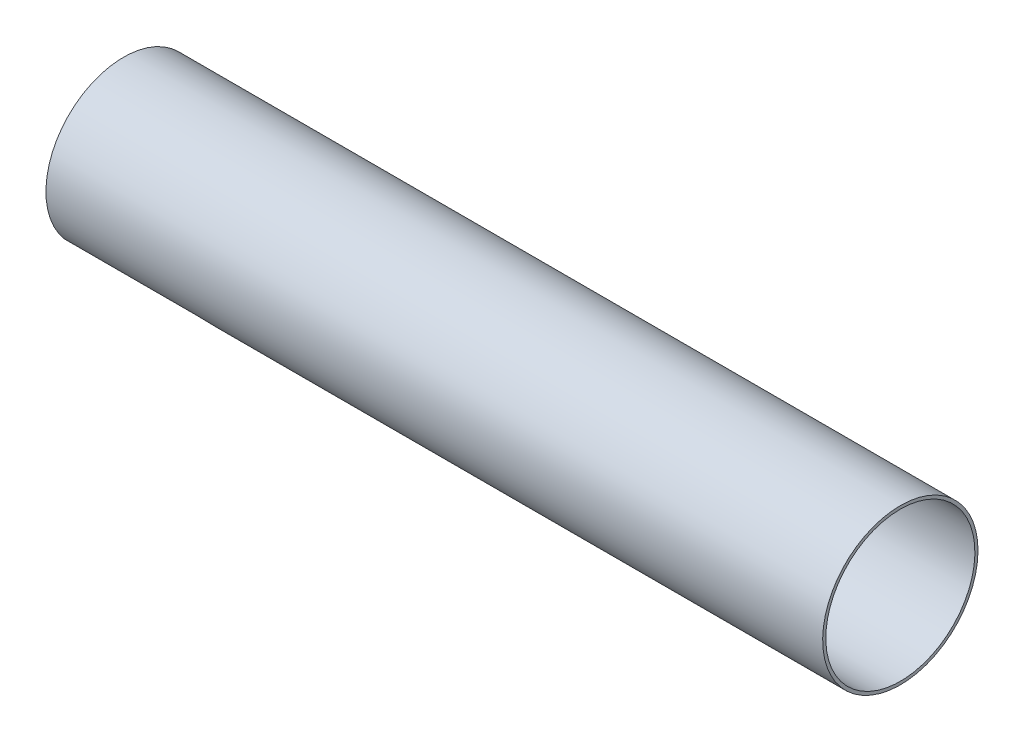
ISO-10303-21;
HEADER;
FILE_DESCRIPTION(('STEP AP214'),'2;1');
FILE_NAME('part.step','',(''),(''),'','','');
FILE_SCHEMA(('AUTOMOTIVE_DESIGN { 1 0 10303 214 1 1 1 1 }'));
ENDSEC;
DATA;
#1=APPLICATION_CONTEXT('core data for automotive mechanical design processes');
#2=APPLICATION_PROTOCOL_DEFINITION('international standard','automotive_design',2000,#1);
#3=PRODUCT_CONTEXT('',#1,'mechanical');
#4=PRODUCT('Part','Part','',(#3));
#5=PRODUCT_RELATED_PRODUCT_CATEGORY('part','',(#4));
#6=PRODUCT_DEFINITION_FORMATION('','',#4);
#7=PRODUCT_DEFINITION_CONTEXT('part definition',#1,'design');
#8=PRODUCT_DEFINITION('design','',#6,#7);
#9=PRODUCT_DEFINITION_SHAPE('','',#8);
#10=(LENGTH_UNIT() NAMED_UNIT(*) SI_UNIT(.MILLI.,.METRE.));
#11=(NAMED_UNIT(*) PLANE_ANGLE_UNIT() SI_UNIT($,.RADIAN.));
#12=(NAMED_UNIT(*) SI_UNIT($,.STERADIAN.) SOLID_ANGLE_UNIT());
#13=UNCERTAINTY_MEASURE_WITH_UNIT(LENGTH_MEASURE(1.E-05),#10,'distance_accuracy_value','');
#14=(GEOMETRIC_REPRESENTATION_CONTEXT(3) GLOBAL_UNCERTAINTY_ASSIGNED_CONTEXT((#13)) GLOBAL_UNIT_ASSIGNED_CONTEXT((#10,
#11,#12)) REPRESENTATION_CONTEXT('',''));
#15=CARTESIAN_POINT('',(0.,0.,0.));
#16=DIRECTION('',(0.,0.,1.));
#17=DIRECTION('',(1.,0.,0.));
#18=AXIS2_PLACEMENT_3D('',#15,#16,#17);
#19=CARTESIAN_POINT('',(300.,0.,0.));
#20=DIRECTION('',(-1.,0.,0.));
#21=DIRECTION('',(0.,0.,1.));
#22=AXIS2_PLACEMENT_3D('',#19,#20,#21);
#23=CYLINDRICAL_SURFACE('',#22,28.8);
#24=DIRECTION('',(-1.,0.,0.));
#25=VECTOR('',#24,1.);
#26=CARTESIAN_POINT('',(300.,-17.333205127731,23.));
#27=LINE('',#26,#25);
#28=CARTESIAN_POINT('',(50.,-17.333205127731,23.));
#29=VERTEX_POINT('',#28);
#30=CARTESIAN_POINT('',(0.,-17.333205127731,23.));
#31=VERTEX_POINT('',#30);
#32=EDGE_CURVE('E82',#29,#31,#27,.T.);
#33=ORIENTED_EDGE('',*,*,#32,.T.);
#34=CARTESIAN_POINT('',(0.,0.,0.));
#35=DIRECTION('',(-1.,0.,0.));
#36=DIRECTION('',(0.,1.,0.));
#37=AXIS2_PLACEMENT_3D('',#34,#35,#36);
#38=CIRCLE('',#37,28.8);
#39=CARTESIAN_POINT('',(0.,-17.333205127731,-23.));
#40=VERTEX_POINT('',#39);
#41=EDGE_CURVE('E76',#31,#40,#38,.T.);
#42=ORIENTED_EDGE('',*,*,#41,.T.);
#43=DIRECTION('',(-1.,0.,0.));
#44=VECTOR('',#43,1.);
#45=CARTESIAN_POINT('',(300.,-17.333205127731,-23.));
#46=LINE('',#45,#44);
#47=CARTESIAN_POINT('',(50.,-17.333205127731,-23.));
#48=VERTEX_POINT('',#47);
#49=EDGE_CURVE('E60',#40,#48,#46,.F.);
#50=ORIENTED_EDGE('',*,*,#49,.T.);
#51=CARTESIAN_POINT('',(50.,-17.333205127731,-23.));
#52=CARTESIAN_POINT('',(50.2186488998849,-17.3331927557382,-23.0000036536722));
#53=CARTESIAN_POINT('',(50.4372639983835,-17.3373443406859,-22.9968812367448));
#54=CARTESIAN_POINT('',(50.873981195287,-17.3538557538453,-22.9844262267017));
#55=CARTESIAN_POINT('',(51.0920833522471,-17.3662145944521,-22.9750943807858));
#56=CARTESIAN_POINT('',(51.7442027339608,-17.4153616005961,-22.9378937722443));
#57=CARTESIAN_POINT('',(52.1768684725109,-17.4642211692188,-22.9008195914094));
#58=CARTESIAN_POINT('',(53.0292346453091,-17.5909280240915,-22.8036278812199));
#59=CARTESIAN_POINT('',(53.4490309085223,-17.6683826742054,-22.7438221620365));
#60=CARTESIAN_POINT('',(54.2794171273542,-17.8490624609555,-22.6023032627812));
#61=CARTESIAN_POINT('',(54.6900024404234,-17.9523002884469,-22.5205792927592));
#62=CARTESIAN_POINT('',(55.6441570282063,-18.2213885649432,-22.3038215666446));
#63=CARTESIAN_POINT('',(56.183171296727,-18.3964545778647,-22.1601627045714));
#64=CARTESIAN_POINT('',(57.2392421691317,-18.7777459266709,-21.8380056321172));
#65=CARTESIAN_POINT('',(57.7562910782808,-18.9839820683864,-21.6594953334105));
#66=CARTESIAN_POINT('',(58.7714638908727,-19.4207920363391,-21.2687393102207));
#67=CARTESIAN_POINT('',(59.2694324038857,-19.6515241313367,-21.0562690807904));
#68=CARTESIAN_POINT('',(60.2428440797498,-20.1289853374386,-20.6003158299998));
#69=CARTESIAN_POINT('',(60.718287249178,-20.375714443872,-20.3568328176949));
#70=CARTESIAN_POINT('',(61.8125950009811,-20.9689474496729,-19.7479710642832));
#71=CARTESIAN_POINT('',(62.4222253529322,-21.3196875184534,-19.3700651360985));
#72=CARTESIAN_POINT('',(63.6013646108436,-22.027598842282,-18.5610931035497));
#73=CARTESIAN_POINT('',(64.1708593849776,-22.3847723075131,-18.1300084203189));
#74=CARTESIAN_POINT('',(65.2677210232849,-23.0947837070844,-17.2164197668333));
#75=CARTESIAN_POINT('',(65.7951641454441,-23.4476284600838,-16.7340127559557));
#76=CARTESIAN_POINT('',(66.8067756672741,-24.140673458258,-15.7176978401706));
#77=CARTESIAN_POINT('',(67.2909583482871,-24.4808778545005,-15.1838070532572));
#78=CARTESIAN_POINT('',(68.1219845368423,-25.0754782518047,-14.1750720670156));
#79=CARTESIAN_POINT('',(68.4771206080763,-25.3336002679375,-13.7092376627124));
#80=CARTESIAN_POINT('',(69.1547513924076,-25.831991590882,-12.7452933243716));
#81=CARTESIAN_POINT('',(69.4772475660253,-26.0722616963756,-12.247184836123));
#82=CARTESIAN_POINT('',(70.0862836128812,-26.5303332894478,-11.2203885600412));
#83=CARTESIAN_POINT('',(70.3728618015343,-26.7481586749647,-10.6917342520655));
#84=CARTESIAN_POINT('',(70.9070709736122,-27.15724782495,-9.60523966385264));
#85=CARTESIAN_POINT('',(71.1547083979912,-27.348515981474,-9.04740423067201));
#86=CARTESIAN_POINT('',(71.5709354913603,-27.6718448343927,-7.99751135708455));
#87=CARTESIAN_POINT('',(71.7458326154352,-27.808479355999,-7.50935671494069));
#88=CARTESIAN_POINT('',(72.0636240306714,-28.0576865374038,-6.5167442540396));
#89=CARTESIAN_POINT('',(72.2065215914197,-28.1702616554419,-6.0122881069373));
#90=CARTESIAN_POINT('',(72.4583173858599,-28.3691745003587,-4.99008251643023));
#91=CARTESIAN_POINT('',(72.5672294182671,-28.4555228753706,-4.47233856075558));
#92=CARTESIAN_POINT('',(72.7494847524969,-28.6002794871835,-3.42673839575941));
#93=CARTESIAN_POINT('',(72.8228276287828,-28.6586873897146,-2.89888206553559));
#94=CARTESIAN_POINT('',(72.9329336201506,-28.746449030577,-1.83507144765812));
#95=CARTESIAN_POINT('',(72.9695678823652,-28.7757004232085,-1.29909529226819));
#96=CARTESIAN_POINT('',(73.0051736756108,-28.8041299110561,-0.225089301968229));
#97=CARTESIAN_POINT('',(73.0041451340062,-28.8033079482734,0.31294053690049));
#98=CARTESIAN_POINT('',(72.9644433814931,-28.7716095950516,1.38672705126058));
#99=CARTESIAN_POINT('',(72.9257690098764,-28.7407322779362,1.92248365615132));
#100=CARTESIAN_POINT('',(72.8114390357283,-28.6496170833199,2.98748581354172));
#101=CARTESIAN_POINT('',(72.7357842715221,-28.5893798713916,3.51673151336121));
#102=CARTESIAN_POINT('',(72.5538125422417,-28.4448867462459,4.5364196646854));
#103=CARTESIAN_POINT('',(72.4493784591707,-28.3621086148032,5.02741111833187));
#104=CARTESIAN_POINT('',(72.2099741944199,-28.1729935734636,5.99720772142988));
#105=CARTESIAN_POINT('',(72.075005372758,-28.0666577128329,6.47601341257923));
#106=CARTESIAN_POINT('',(71.7761686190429,-27.8322283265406,7.41911305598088));
#107=CARTESIAN_POINT('',(71.612295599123,-27.7041309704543,7.88340443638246));
#108=CARTESIAN_POINT('',(71.2574549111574,-27.428214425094,8.79545916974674));
#109=CARTESIAN_POINT('',(71.0664856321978,-27.2803940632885,9.24322153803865));
#110=CARTESIAN_POINT('',(70.6395601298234,-26.9520140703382,10.1631675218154));
#111=CARTESIAN_POINT('',(70.4010390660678,-26.7696706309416,10.6335231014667));
#112=CARTESIAN_POINT('',(69.8958913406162,-26.3867269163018,11.5510976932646));
#113=CARTESIAN_POINT('',(69.6292631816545,-26.1861256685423,11.9983154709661));
#114=CARTESIAN_POINT('',(69.0699815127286,-25.769543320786,12.8687000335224));
#115=CARTESIAN_POINT('',(68.7773249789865,-25.55356043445,13.2918640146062));
#116=CARTESIAN_POINT('',(68.1678339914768,-25.109096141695,14.113522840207));
#117=CARTESIAN_POINT('',(67.8509962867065,-24.880613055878,14.5120143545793));
#118=CARTESIAN_POINT('',(67.127291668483,-24.3660959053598,15.3632297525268));
#119=CARTESIAN_POINT('',(66.7152984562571,-24.0778790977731,15.810284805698));
#120=CARTESIAN_POINT('',(65.860511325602,-23.4925253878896,16.6676556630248));
#121=CARTESIAN_POINT('',(65.4177124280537,-23.195387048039,17.0779655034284));
#122=CARTESIAN_POINT('',(64.5016892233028,-22.5968676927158,17.8624037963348));
#123=CARTESIAN_POINT('',(64.0283983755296,-22.2954786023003,18.2364483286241));
#124=CARTESIAN_POINT('',(63.0530078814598,-21.6950040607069,18.9468467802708));
#125=CARTESIAN_POINT('',(62.5509112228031,-21.3959183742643,19.283204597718));
#126=CARTESIAN_POINT('',(61.5688598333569,-20.835842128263,19.8861740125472));
#127=CARTESIAN_POINT('',(61.0916033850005,-20.5740031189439,20.1563925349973));
#128=CARTESIAN_POINT('',(60.1133115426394,-20.0635216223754,20.6645773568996));
#129=CARTESIAN_POINT('',(59.6122752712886,-19.8148796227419,20.9025424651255));
#130=CARTESIAN_POINT('',(58.5892704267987,-19.3393826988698,21.3432117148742));
#131=CARTESIAN_POINT('',(58.0674527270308,-19.1124009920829,21.5461275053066));
#132=CARTESIAN_POINT('',(56.9999082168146,-18.6868763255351,21.9162083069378));
#133=CARTESIAN_POINT('',(56.454185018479,-18.4883290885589,22.0833786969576));
#134=CARTESIAN_POINT('',(55.4343182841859,-18.1598431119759,22.3539140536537));
#135=CARTESIAN_POINT('',(54.9636851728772,-18.0239799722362,22.4632889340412));
#136=CARTESIAN_POINT('',(54.0086472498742,-17.7847165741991,22.653196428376));
#137=CARTESIAN_POINT('',(53.5242524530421,-17.6812933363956,22.7337494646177));
#138=CARTESIAN_POINT('',(52.7859366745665,-17.5539523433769,22.8320308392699));
#139=CARTESIAN_POINT('',(52.535867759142,-17.5159520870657,22.8611705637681));
#140=CARTESIAN_POINT('',(52.0335474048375,-17.450311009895,22.9113151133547));
#141=CARTESIAN_POINT('',(51.781296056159,-17.4226697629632,22.9323202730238));
#142=CARTESIAN_POINT('',(51.2746230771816,-17.3781727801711,22.9660605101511));
#143=CARTESIAN_POINT('',(51.0201974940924,-17.3613454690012,22.9787737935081));
#144=CARTESIAN_POINT('',(50.5105193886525,-17.3388432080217,22.9957507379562));
#145=CARTESIAN_POINT('',(50.2552666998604,-17.3331706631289,23.0000125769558));
#146=CARTESIAN_POINT('',(50.,-17.333205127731,23.));
#147=B_SPLINE_CURVE_WITH_KNOTS('',3,(#51,#52,#53,#54,#55,#56,#57,#58,#59,#60,#61,#62,#63,#64,
#65,#66,#67,#68,#69,#70,#71,#72,#73,#74,#75,#76,#77,#78,#79,#80,#81,#82,#83,#84,#85,#86,#87,#88,
#89,#90,#91,#92,#93,#94,#95,#96,#97,#98,#99,#100,#101,#102,#103,#104,#105,#106,#107,#108,#109,
#110,#111,#112,#113,#114,#115,#116,#117,#118,#119,#120,#121,#122,#123,#124,#125,#126,#127,#128,
#129,#130,#131,#132,#133,#134,#135,#136,#137,#138,#139,#140,#141,#142,#143,#144,#145,#146),
.UNSPECIFIED.,.F.,.F.,(4,2,2,2,2,2,2,2,2,2,2,2,2,2,2,2,2,2,2,2,2,2,2,2,2,2,2,2,2,2,2,2,2,2,2,2,
2,2,2,2,2,2,2,2,2,2,2,4),(0.,0.655819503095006,1.31156010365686,2.62054453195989,
3.91218617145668,5.20446483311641,6.95566782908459,8.70747931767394,10.4713911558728,
12.2353024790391,14.6274959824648,17.0205276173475,19.4091159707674,21.7969128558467,
23.7155436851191,25.6340886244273,27.5505692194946,29.4667324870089,31.073832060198,
32.6807673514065,34.2870493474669,35.8933505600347,37.5052705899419,39.1171937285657,
40.7291665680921,42.3411028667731,43.8657243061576,45.3902778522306,46.9151000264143,
48.4400128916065,50.1124484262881,51.7849730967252,53.4576923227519,55.1306368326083,
57.1471450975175,59.1639800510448,61.1853759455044,63.2065625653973,65.0284572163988,
66.8504191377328,68.6609620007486,70.4712322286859,71.9752304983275,73.4781609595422,
74.2417067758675,75.0052211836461,75.7707343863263,76.5364126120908),.UNSPECIFIED.);
#148=EDGE_CURVE('E156',#48,#29,#147,.T.);
#149=ORIENTED_EDGE('',*,*,#148,.T.);
#150=EDGE_LOOP('',(#33,#42,#50,#149));
#151=FACE_BOUND('',#150,.T.);
#152=CARTESIAN_POINT('',(147.5,-28.1680670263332,-6.));
#153=CARTESIAN_POINT('',(147.333406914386,-28.1680650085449,-6.00000356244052));
#154=CARTESIAN_POINT('',(147.16685735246,-28.1695476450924,-5.99305998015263));
#155=CARTESIAN_POINT('',(146.834914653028,-28.1754295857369,-5.96534881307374));
#156=CARTESIAN_POINT('',(146.669521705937,-28.1798293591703,-5.94457900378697));
#157=CARTESIAN_POINT('',(146.341057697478,-28.1914203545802,-5.88936394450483));
#158=CARTESIAN_POINT('',(146.177987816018,-28.1986129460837,-5.8549119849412));
#159=CARTESIAN_POINT('',(145.855343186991,-28.2155796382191,-5.77259312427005));
#160=CARTESIAN_POINT('',(145.695769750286,-28.2253546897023,-5.72472128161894));
#161=CARTESIAN_POINT('',(145.381519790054,-28.2471842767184,-5.61601690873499));
#162=CARTESIAN_POINT('',(145.226836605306,-28.2592355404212,-5.55520296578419));
#163=CARTESIAN_POINT('',(144.923126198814,-28.2852855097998,-5.42100490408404));
#164=CARTESIAN_POINT('',(144.774101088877,-28.2992849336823,-5.34761614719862));
#165=CARTESIAN_POINT('',(144.482826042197,-28.3288254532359,-5.18884977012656));
#166=CARTESIAN_POINT('',(144.340573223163,-28.344365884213,-5.10347731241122));
#167=CARTESIAN_POINT('',(144.06365775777,-28.3765664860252,-4.9212835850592));
#168=CARTESIAN_POINT('',(143.928997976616,-28.3932270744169,-4.82445803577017));
#169=CARTESIAN_POINT('',(143.666454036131,-28.4274322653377,-4.6186703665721));
#170=CARTESIAN_POINT('',(143.53868486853,-28.4449857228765,-4.5095629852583));
#171=CARTESIAN_POINT('',(143.292710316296,-28.4802819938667,-4.2809941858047));
#172=CARTESIAN_POINT('',(143.174508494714,-28.4980248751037,-4.16152894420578));
#173=CARTESIAN_POINT('',(142.94855085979,-28.5331953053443,-3.91311809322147));
#174=CARTESIAN_POINT('',(142.840792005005,-28.5506229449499,-3.78417526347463));
#175=CARTESIAN_POINT('',(142.636382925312,-28.5846918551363,-3.51759183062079));
#176=CARTESIAN_POINT('',(142.539736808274,-28.6013328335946,-3.37994804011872));
#177=CARTESIAN_POINT('',(142.357448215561,-28.6335068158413,-3.09563161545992));
#178=CARTESIAN_POINT('',(142.271914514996,-28.6490282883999,-2.94888789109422));
#179=CARTESIAN_POINT('',(142.113502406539,-28.6783593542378,-2.64848882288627));
#180=CARTESIAN_POINT('',(142.040628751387,-28.6921683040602,-2.49483091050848));
#181=CARTESIAN_POINT('',(141.908162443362,-28.7176672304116,-2.18179008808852));
#182=CARTESIAN_POINT('',(141.84856382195,-28.7293581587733,-2.02240978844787));
#183=CARTESIAN_POINT('',(141.743059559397,-28.7502996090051,-1.6990070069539));
#184=CARTESIAN_POINT('',(141.697158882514,-28.7595492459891,-1.53498286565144));
#185=CARTESIAN_POINT('',(141.581782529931,-28.7829702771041,-1.04257340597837));
#186=CARTESIAN_POINT('',(141.53258084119,-28.7932219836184,-0.708979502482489));
#187=CARTESIAN_POINT('',(141.490710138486,-28.8019302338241,-0.038309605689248));
#188=CARTESIAN_POINT('',(141.498035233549,-28.8003880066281,0.298766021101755));
#189=CARTESIAN_POINT('',(141.568330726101,-28.785822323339,0.961554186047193));
#190=CARTESIAN_POINT('',(141.630439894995,-28.7729765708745,1.28736181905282));
#191=CARTESIAN_POINT('',(141.807192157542,-28.7374429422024,1.9238135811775));
#192=CARTESIAN_POINT('',(141.921837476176,-28.7147546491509,2.2344570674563));
#193=CARTESIAN_POINT('',(142.201184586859,-28.6617967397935,2.8342070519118));
#194=CARTESIAN_POINT('',(142.366219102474,-28.6314769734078,3.12315398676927));
#195=CARTESIAN_POINT('',(142.741414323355,-28.5665904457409,3.66956885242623));
#196=CARTESIAN_POINT('',(142.95158063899,-28.5320231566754,3.9270328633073));
#197=CARTESIAN_POINT('',(143.415783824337,-28.4616816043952,4.40829210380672));
#198=CARTESIAN_POINT('',(143.670574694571,-28.4258968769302,4.63135912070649));
#199=CARTESIAN_POINT('',(144.214313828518,-28.3577698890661,5.03172468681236));
#200=CARTESIAN_POINT('',(144.50326285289,-28.3254277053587,5.20902221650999));
#201=CARTESIAN_POINT('',(145.108218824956,-28.2678239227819,5.51309841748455));
#202=CARTESIAN_POINT('',(145.424291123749,-28.2425800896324,5.63975066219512));
#203=CARTESIAN_POINT('',(146.073879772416,-28.2022851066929,5.83793172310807));
#204=CARTESIAN_POINT('',(146.407393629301,-28.1872325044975,5.90946839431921));
#205=CARTESIAN_POINT('',(147.075774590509,-28.1693175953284,5.99428146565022));
#206=CARTESIAN_POINT('',(147.410502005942,-28.1662344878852,6.00861326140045));
#207=CARTESIAN_POINT('',(148.077563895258,-28.1720136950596,5.98145728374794));
#208=CARTESIAN_POINT('',(148.409898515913,-28.1808752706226,5.93997296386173));
#209=CARTESIAN_POINT('',(149.059138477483,-28.2093378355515,5.80327480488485));
#210=CARTESIAN_POINT('',(149.376169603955,-28.2288245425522,5.70863240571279));
#211=CARTESIAN_POINT('',(149.989875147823,-28.2762402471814,5.46891890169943));
#212=CARTESIAN_POINT('',(150.286547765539,-28.3041699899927,5.32384334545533));
#213=CARTESIAN_POINT('',(150.855710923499,-28.3658160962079,4.9850207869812));
#214=CARTESIAN_POINT('',(151.127802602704,-28.3996083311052,4.79061785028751));
#215=CARTESIAN_POINT('',(151.635887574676,-28.4689672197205,4.35952503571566));
#216=CARTESIAN_POINT('',(151.871876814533,-28.504534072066,4.12283041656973));
#217=CARTESIAN_POINT('',(152.305101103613,-28.5741564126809,3.60912322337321));
#218=CARTESIAN_POINT('',(152.501619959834,-28.6081765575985,3.33150114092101));
#219=CARTESIAN_POINT('',(152.845225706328,-28.6702418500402,2.74655650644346));
#220=CARTESIAN_POINT('',(152.992314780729,-28.6982872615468,2.43923526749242));
#221=CARTESIAN_POINT('',(153.231866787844,-28.7450957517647,1.80549695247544));
#222=CARTESIAN_POINT('',(153.324656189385,-28.7639141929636,1.47920724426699));
#223=CARTESIAN_POINT('',(153.453984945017,-28.7903765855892,0.815049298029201));
#224=CARTESIAN_POINT('',(153.490531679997,-28.7980220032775,0.477182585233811));
#225=CARTESIAN_POINT('',(153.502249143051,-28.800471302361,-0.0270973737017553));
#226=CARTESIAN_POINT('',(153.499189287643,-28.7998302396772,-0.193262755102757));
#227=CARTESIAN_POINT('',(153.479312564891,-28.7956948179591,-0.52471594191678));
#228=CARTESIAN_POINT('',(153.462500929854,-28.7922015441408,-0.690004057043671));
#229=CARTESIAN_POINT('',(153.415240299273,-28.7824520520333,-1.01858112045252));
#230=CARTESIAN_POINT('',(153.384786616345,-28.7761948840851,-1.18186936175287));
#231=CARTESIAN_POINT('',(153.310498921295,-28.7610947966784,-1.50519152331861));
#232=CARTESIAN_POINT('',(153.266669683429,-28.7522527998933,-1.6652265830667));
#233=CARTESIAN_POINT('',(153.16608297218,-28.7322480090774,-1.98061582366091));
#234=CARTESIAN_POINT('',(153.109355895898,-28.7210906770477,-2.13598005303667));
#235=CARTESIAN_POINT('',(152.983363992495,-28.6967500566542,-2.44130795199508));
#236=CARTESIAN_POINT('',(152.914103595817,-28.6835674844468,-2.59127350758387));
#237=CARTESIAN_POINT('',(152.763501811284,-28.6555226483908,-2.88492433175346));
#238=CARTESIAN_POINT('',(152.682155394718,-28.6406596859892,-3.02860695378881));
#239=CARTESIAN_POINT('',(152.508004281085,-28.60966218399,-3.30863580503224));
#240=CARTESIAN_POINT('',(152.415203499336,-28.593528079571,-3.44498451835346));
#241=CARTESIAN_POINT('',(152.217006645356,-28.5601198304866,-3.71186788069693));
#242=CARTESIAN_POINT('',(152.111416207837,-28.5428305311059,-3.8422563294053));
#243=CARTESIAN_POINT('',(151.889760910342,-28.5078591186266,-4.09366267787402));
#244=CARTESIAN_POINT('',(151.773699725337,-28.4901771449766,-4.21468383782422));
#245=CARTESIAN_POINT('',(151.531779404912,-28.4548927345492,-4.44666804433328));
#246=CARTESIAN_POINT('',(151.405914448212,-28.4372903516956,-4.55762502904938));
#247=CARTESIAN_POINT('',(151.145335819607,-28.4026725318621,-4.76860783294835));
#248=CARTESIAN_POINT('',(151.010625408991,-28.3856568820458,-4.86863764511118));
#249=CARTESIAN_POINT('',(150.731504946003,-28.352481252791,-5.05827942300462));
#250=CARTESIAN_POINT('',(150.586996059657,-28.3363343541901,-5.14774829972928));
#251=CARTESIAN_POINT('',(150.290838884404,-28.305601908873,-5.31413759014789));
#252=CARTESIAN_POINT('',(150.139193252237,-28.2910157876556,-5.39106262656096));
#253=CARTESIAN_POINT('',(149.829854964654,-28.2638375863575,-5.53178314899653));
#254=CARTESIAN_POINT('',(149.672165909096,-28.2512443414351,-5.59558631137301));
#255=CARTESIAN_POINT('',(149.351839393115,-28.2284211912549,-5.70960635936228));
#256=CARTESIAN_POINT('',(149.189202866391,-28.2181908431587,-5.75982579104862));
#257=CARTESIAN_POINT('',(148.776406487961,-28.1958851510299,-5.86826926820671));
#258=CARTESIAN_POINT('',(148.523758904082,-28.1855130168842,-5.91759790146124));
#259=CARTESIAN_POINT('',(148.014039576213,-28.1716056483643,-5.98345985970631));
#260=CARTESIAN_POINT('',(147.756968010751,-28.1680701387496,-5.99999450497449));
#261=CARTESIAN_POINT('',(147.5,-28.1680670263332,-6.));
#262=B_SPLINE_CURVE_WITH_KNOTS('',3,(#152,#153,#154,#155,#156,#157,#158,#159,#160,#161,#162,
#163,#164,#165,#166,#167,#168,#169,#170,#171,#172,#173,#174,#175,#176,#177,#178,#179,#180,#181,
#182,#183,#184,#185,#186,#187,#188,#189,#190,#191,#192,#193,#194,#195,#196,#197,#198,#199,#200,
#201,#202,#203,#204,#205,#206,#207,#208,#209,#210,#211,#212,#213,#214,#215,#216,#217,#218,#219,
#220,#221,#222,#223,#224,#225,#226,#227,#228,#229,#230,#231,#232,#233,#234,#235,#236,#237,#238,
#239,#240,#241,#242,#243,#244,#245,#246,#247,#248,#249,#250,#251,#252,#253,#254,#255,#256,#257,
#258,#259,#260,#261),.UNSPECIFIED.,.T.,.F.,(4,2,2,2,2,2,2,2,2,2,2,2,2,2,2,2,2,2,2,2,2,2,2,2,2,2,
2,2,2,2,2,2,2,2,2,2,2,2,2,2,2,2,2,2,2,2,2,2,2,2,2,2,2,2,4),(0.,0.499553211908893,
0.999186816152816,1.49906573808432,1.99912897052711,2.49847880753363,2.99801322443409,
3.49733310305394,3.99684015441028,4.50304150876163,5.00943052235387,5.51567160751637,
6.0220992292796,6.53316067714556,7.04441357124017,7.55543613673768,8.06664367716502,
9.07336153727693,10.0799744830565,11.0710395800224,12.062146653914,13.0599450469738,
14.0578675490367,15.0746485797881,16.0914522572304,17.1107785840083,18.1299596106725,
19.1302479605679,20.1304744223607,21.1201489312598,22.109910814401,23.1135952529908,
24.1173922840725,25.138021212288,26.1586050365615,27.1729879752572,28.1872377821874,
28.685335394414,29.1832435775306,29.6813229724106,30.1792247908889,30.6759651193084,
31.1725301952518,31.6693024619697,32.1659053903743,32.6713249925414,33.1765678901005,
33.6821131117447,34.187472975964,34.6990415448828,35.2104211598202,35.7215007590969,
36.2324844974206,37.0030708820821,37.7736262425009),.UNSPECIFIED.);
#263=CARTESIAN_POINT('',(147.5,-28.1680670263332,-6.));
#264=VERTEX_POINT('',#263);
#265=EDGE_CURVE('E151',#264,#264,#262,.T.);
#266=ORIENTED_EDGE('',*,*,#265,.F.);
#267=EDGE_LOOP('',(#266));
#268=FACE_BOUND('',#267,.T.);
#269=CARTESIAN_POINT('',(87.5,-28.1680670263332,-6.));
#270=CARTESIAN_POINT('',(87.3334069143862,-28.1680650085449,-6.00000356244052));
#271=CARTESIAN_POINT('',(87.1668573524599,-28.1695476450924,-5.99305998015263));
#272=CARTESIAN_POINT('',(86.8349146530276,-28.1754295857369,-5.96534881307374));
#273=CARTESIAN_POINT('',(86.6695217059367,-28.1798293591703,-5.94457900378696));
#274=CARTESIAN_POINT('',(86.3410576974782,-28.1914203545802,-5.88936394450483));
#275=CARTESIAN_POINT('',(86.1779878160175,-28.1986129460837,-5.8549119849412));
#276=CARTESIAN_POINT('',(85.8553431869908,-28.2155796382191,-5.77259312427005));
#277=CARTESIAN_POINT('',(85.6957697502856,-28.2253546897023,-5.72472128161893));
#278=CARTESIAN_POINT('',(85.3815197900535,-28.2471842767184,-5.61601690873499));
#279=CARTESIAN_POINT('',(85.2268366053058,-28.2592355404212,-5.55520296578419));
#280=CARTESIAN_POINT('',(84.9231261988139,-28.2852855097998,-5.42100490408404));
#281=CARTESIAN_POINT('',(84.7741010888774,-28.2992849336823,-5.34761614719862));
#282=CARTESIAN_POINT('',(84.4828260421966,-28.3288254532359,-5.18884977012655));
#283=CARTESIAN_POINT('',(84.3405732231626,-28.344365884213,-5.10347731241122));
#284=CARTESIAN_POINT('',(84.0636577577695,-28.3765664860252,-4.9212835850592));
#285=CARTESIAN_POINT('',(83.9289979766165,-28.3932270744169,-4.82445803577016));
#286=CARTESIAN_POINT('',(83.6664540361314,-28.4274322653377,-4.6186703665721));
#287=CARTESIAN_POINT('',(83.5386848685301,-28.4449857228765,-4.50956298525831));
#288=CARTESIAN_POINT('',(83.2927103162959,-28.4802819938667,-4.28099418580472));
#289=CARTESIAN_POINT('',(83.1745084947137,-28.4980248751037,-4.16152894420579));
#290=CARTESIAN_POINT('',(82.9485508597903,-28.5331953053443,-3.91311809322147));
#291=CARTESIAN_POINT('',(82.8407920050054,-28.5506229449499,-3.78417526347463));
#292=CARTESIAN_POINT('',(82.6363829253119,-28.5846918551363,-3.51759183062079));
#293=CARTESIAN_POINT('',(82.5397368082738,-28.6013328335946,-3.37994804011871));
#294=CARTESIAN_POINT('',(82.3574482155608,-28.6335068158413,-3.09563161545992));
#295=CARTESIAN_POINT('',(82.271914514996,-28.6490282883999,-2.94888789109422));
#296=CARTESIAN_POINT('',(82.1135024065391,-28.6783593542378,-2.64848882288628));
#297=CARTESIAN_POINT('',(82.0406287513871,-28.6921683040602,-2.49483091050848));
#298=CARTESIAN_POINT('',(81.9081624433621,-28.7176672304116,-2.18179008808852));
#299=CARTESIAN_POINT('',(81.8485638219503,-28.7293581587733,-2.02240978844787));
#300=CARTESIAN_POINT('',(81.7430595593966,-28.7502996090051,-1.6990070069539));
#301=CARTESIAN_POINT('',(81.6971588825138,-28.7595492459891,-1.53498286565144));
#302=CARTESIAN_POINT('',(81.5817825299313,-28.7829702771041,-1.04257340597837));
#303=CARTESIAN_POINT('',(81.5325808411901,-28.7932219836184,-0.708979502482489));
#304=CARTESIAN_POINT('',(81.4907101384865,-28.8019302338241,-0.0383096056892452));
#305=CARTESIAN_POINT('',(81.4980352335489,-28.8003880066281,0.29876602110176));
#306=CARTESIAN_POINT('',(81.5683307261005,-28.785822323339,0.961554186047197));
#307=CARTESIAN_POINT('',(81.630439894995,-28.7729765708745,1.28736181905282));
#308=CARTESIAN_POINT('',(81.8071921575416,-28.7374429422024,1.9238135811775));
#309=CARTESIAN_POINT('',(81.921837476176,-28.7147546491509,2.2344570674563));
#310=CARTESIAN_POINT('',(82.2011845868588,-28.6617967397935,2.8342070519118));
#311=CARTESIAN_POINT('',(82.3662191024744,-28.6314769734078,3.12315398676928));
#312=CARTESIAN_POINT('',(82.7414143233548,-28.5665904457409,3.66956885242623));
#313=CARTESIAN_POINT('',(82.9515806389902,-28.5320231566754,3.9270328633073));
#314=CARTESIAN_POINT('',(83.4157838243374,-28.4616816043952,4.40829210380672));
#315=CARTESIAN_POINT('',(83.6705746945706,-28.4258968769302,4.6313591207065));
#316=CARTESIAN_POINT('',(84.2143138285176,-28.3577698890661,5.03172468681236));
#317=CARTESIAN_POINT('',(84.5032628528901,-28.3254277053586,5.20902221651));
#318=CARTESIAN_POINT('',(85.1082188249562,-28.2678239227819,5.51309841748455));
#319=CARTESIAN_POINT('',(85.4242911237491,-28.2425800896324,5.63975066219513));
#320=CARTESIAN_POINT('',(86.0738797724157,-28.2022851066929,5.83793172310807));
#321=CARTESIAN_POINT('',(86.4073936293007,-28.1872325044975,5.90946839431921));
#322=CARTESIAN_POINT('',(87.0757745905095,-28.1693175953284,5.99428146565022));
#323=CARTESIAN_POINT('',(87.4105020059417,-28.1662344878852,6.00861326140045));
#324=CARTESIAN_POINT('',(88.077563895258,-28.1720136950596,5.98145728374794));
#325=CARTESIAN_POINT('',(88.4098985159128,-28.1808752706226,5.93997296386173));
#326=CARTESIAN_POINT('',(89.0591384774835,-28.2093378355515,5.80327480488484));
#327=CARTESIAN_POINT('',(89.3761696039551,-28.2288245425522,5.70863240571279));
#328=CARTESIAN_POINT('',(89.9898751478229,-28.2762402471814,5.46891890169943));
#329=CARTESIAN_POINT('',(90.286547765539,-28.3041699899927,5.32384334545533));
#330=CARTESIAN_POINT('',(90.8557109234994,-28.3658160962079,4.98502078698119));
#331=CARTESIAN_POINT('',(91.1278026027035,-28.3996083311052,4.79061785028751));
#332=CARTESIAN_POINT('',(91.635887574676,-28.4689672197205,4.35952503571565));
#333=CARTESIAN_POINT('',(91.8718768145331,-28.504534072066,4.12283041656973));
#334=CARTESIAN_POINT('',(92.3051011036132,-28.5741564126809,3.60912322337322));
#335=CARTESIAN_POINT('',(92.5016199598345,-28.6081765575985,3.33150114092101));
#336=CARTESIAN_POINT('',(92.8452257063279,-28.6702418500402,2.74655650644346));
#337=CARTESIAN_POINT('',(92.9923147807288,-28.6982872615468,2.43923526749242));
#338=CARTESIAN_POINT('',(93.2318667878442,-28.7450957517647,1.80549695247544));
#339=CARTESIAN_POINT('',(93.324656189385,-28.7639141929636,1.47920724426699));
#340=CARTESIAN_POINT('',(93.4539849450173,-28.7903765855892,0.815049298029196));
#341=CARTESIAN_POINT('',(93.4905316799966,-28.7980220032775,0.477182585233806));
#342=CARTESIAN_POINT('',(93.5022491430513,-28.800471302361,-0.0270973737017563));
#343=CARTESIAN_POINT('',(93.4991892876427,-28.7998302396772,-0.193262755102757));
#344=CARTESIAN_POINT('',(93.4793125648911,-28.7956948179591,-0.524715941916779));
#345=CARTESIAN_POINT('',(93.4625009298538,-28.7922015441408,-0.690004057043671));
#346=CARTESIAN_POINT('',(93.4152402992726,-28.7824520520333,-1.01858112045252));
#347=CARTESIAN_POINT('',(93.3847866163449,-28.7761948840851,-1.18186936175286));
#348=CARTESIAN_POINT('',(93.3104989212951,-28.7610947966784,-1.50519152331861));
#349=CARTESIAN_POINT('',(93.2666696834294,-28.7522527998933,-1.6652265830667));
#350=CARTESIAN_POINT('',(93.1660829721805,-28.7322480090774,-1.98061582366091));
#351=CARTESIAN_POINT('',(93.1093558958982,-28.7210906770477,-2.13598005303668));
#352=CARTESIAN_POINT('',(92.9833639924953,-28.6967500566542,-2.44130795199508));
#353=CARTESIAN_POINT('',(92.9141035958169,-28.6835674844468,-2.59127350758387));
#354=CARTESIAN_POINT('',(92.7635018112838,-28.6555226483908,-2.88492433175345));
#355=CARTESIAN_POINT('',(92.6821553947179,-28.6406596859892,-3.02860695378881));
#356=CARTESIAN_POINT('',(92.5080042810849,-28.60966218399,-3.30863580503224));
#357=CARTESIAN_POINT('',(92.415203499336,-28.593528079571,-3.44498451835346));
#358=CARTESIAN_POINT('',(92.2170066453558,-28.5601198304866,-3.71186788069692));
#359=CARTESIAN_POINT('',(92.1114162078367,-28.5428305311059,-3.8422563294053));
#360=CARTESIAN_POINT('',(91.889760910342,-28.5078591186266,-4.09366267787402));
#361=CARTESIAN_POINT('',(91.7736997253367,-28.4901771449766,-4.21468383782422));
#362=CARTESIAN_POINT('',(91.5317794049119,-28.4548927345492,-4.44666804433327));
#363=CARTESIAN_POINT('',(91.4059144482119,-28.4372903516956,-4.55762502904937));
#364=CARTESIAN_POINT('',(91.1453358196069,-28.4026725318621,-4.76860783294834));
#365=CARTESIAN_POINT('',(91.0106254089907,-28.3856568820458,-4.86863764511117));
#366=CARTESIAN_POINT('',(90.7315049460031,-28.352481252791,-5.05827942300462));
#367=CARTESIAN_POINT('',(90.5869960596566,-28.3363343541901,-5.14774829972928));
#368=CARTESIAN_POINT('',(90.2908388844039,-28.305601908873,-5.3141375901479));
#369=CARTESIAN_POINT('',(90.1391932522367,-28.2910157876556,-5.39106262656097));
#370=CARTESIAN_POINT('',(89.8298549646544,-28.2638375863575,-5.53178314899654));
#371=CARTESIAN_POINT('',(89.6721659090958,-28.2512443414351,-5.59558631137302));
#372=CARTESIAN_POINT('',(89.3518393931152,-28.2284211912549,-5.70960635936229));
#373=CARTESIAN_POINT('',(89.1892028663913,-28.2181908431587,-5.75982579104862));
#374=CARTESIAN_POINT('',(88.7764064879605,-28.1958851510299,-5.8682692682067));
#375=CARTESIAN_POINT('',(88.5237589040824,-28.1855130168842,-5.91759790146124));
#376=CARTESIAN_POINT('',(88.0140395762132,-28.1716056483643,-5.98345985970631));
#377=CARTESIAN_POINT('',(87.7569680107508,-28.1680701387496,-5.99999450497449));
#378=CARTESIAN_POINT('',(87.5,-28.1680670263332,-6.));
#379=B_SPLINE_CURVE_WITH_KNOTS('',3,(#269,#270,#271,#272,#273,#274,#275,#276,#277,#278,#279,
#280,#281,#282,#283,#284,#285,#286,#287,#288,#289,#290,#291,#292,#293,#294,#295,#296,#297,#298,
#299,#300,#301,#302,#303,#304,#305,#306,#307,#308,#309,#310,#311,#312,#313,#314,#315,#316,#317,
#318,#319,#320,#321,#322,#323,#324,#325,#326,#327,#328,#329,#330,#331,#332,#333,#334,#335,#336,
#337,#338,#339,#340,#341,#342,#343,#344,#345,#346,#347,#348,#349,#350,#351,#352,#353,#354,#355,
#356,#357,#358,#359,#360,#361,#362,#363,#364,#365,#366,#367,#368,#369,#370,#371,#372,#373,#374,
#375,#376,#377,#378),.UNSPECIFIED.,.T.,.F.,(4,2,2,2,2,2,2,2,2,2,2,2,2,2,2,2,2,2,2,2,2,2,2,2,2,2,
2,2,2,2,2,2,2,2,2,2,2,2,2,2,2,2,2,2,2,2,2,2,2,2,2,2,2,2,4),(0.,0.499553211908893,
0.999186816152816,1.49906573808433,1.99912897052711,2.49847880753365,2.99801322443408,
3.49733310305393,3.99684015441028,4.5030415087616,5.00943052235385,5.51567160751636,
6.0220992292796,6.53316067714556,7.04441357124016,7.55543613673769,8.06664367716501,
9.07336153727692,10.0799744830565,11.0710395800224,12.062146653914,13.0599450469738,
14.0578675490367,15.0746485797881,16.0914522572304,17.1107785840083,18.1299596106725,
19.1302479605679,20.1304744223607,21.1201489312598,22.109910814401,23.1135952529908,
24.1173922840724,25.138021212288,26.1586050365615,27.1729879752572,28.1872377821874,
28.685335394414,29.1832435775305,29.6813229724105,30.1792247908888,30.6759651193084,
31.1725301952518,31.6693024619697,32.1659053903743,32.6713249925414,33.1765678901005,
33.6821131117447,34.187472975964,34.6990415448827,35.2104211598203,35.7215007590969,
36.2324844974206,37.0030708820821,37.7736262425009),.UNSPECIFIED.);
#380=CARTESIAN_POINT('',(87.5,-28.1680670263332,-6.));
#381=VERTEX_POINT('',#380);
#382=EDGE_CURVE('E92',#381,#381,#379,.T.);
#383=ORIENTED_EDGE('',*,*,#382,.F.);
#384=EDGE_LOOP('',(#383));
#385=FACE_BOUND('',#384,.T.);
#386=CARTESIAN_POINT('',(300.,0.,0.));
#387=DIRECTION('',(-1.,0.,0.));
#388=DIRECTION('',(0.,1.,0.));
#389=AXIS2_PLACEMENT_3D('',#386,#387,#388);
#390=CIRCLE('',#389,28.8);
#391=CARTESIAN_POINT('',(300.,28.8,0.));
#392=VERTEX_POINT('',#391);
#393=EDGE_CURVE('E90',#392,#392,#390,.T.);
#394=ORIENTED_EDGE('',*,*,#393,.F.);
#395=EDGE_LOOP('',(#394));
#396=FACE_BOUND('',#395,.T.);
#397=ADVANCED_FACE('F14',(#151,#268,#385,#396),#23,.F.);
#398=CARTESIAN_POINT('',(300.,0.,0.));
#399=DIRECTION('',(-1.,0.,0.));
#400=DIRECTION('',(0.,0.,1.));
#401=AXIS2_PLACEMENT_3D('',#398,#399,#400);
#402=CYLINDRICAL_SURFACE('',#401,30.);
#403=CARTESIAN_POINT('',(0.,0.,0.));
#404=DIRECTION('',(-1.,0.,0.));
#405=DIRECTION('',(0.,1.,0.));
#406=AXIS2_PLACEMENT_3D('',#403,#404,#405);
#407=CIRCLE('',#406,30.);
#408=CARTESIAN_POINT('',(0.,-19.2613602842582,23.));
#409=VERTEX_POINT('',#408);
#410=CARTESIAN_POINT('',(0.,-19.2613602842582,-23.));
#411=VERTEX_POINT('',#410);
#412=EDGE_CURVE('E40',#409,#411,#407,.T.);
#413=ORIENTED_EDGE('',*,*,#412,.F.);
#414=DIRECTION('',(-1.,0.,0.));
#415=VECTOR('',#414,1.);
#416=CARTESIAN_POINT('',(300.,-19.2613602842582,23.));
#417=LINE('',#416,#415);
#418=CARTESIAN_POINT('',(50.,-19.2613602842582,23.));
#419=VERTEX_POINT('',#418);
#420=EDGE_CURVE('E70',#419,#409,#417,.T.);
#421=ORIENTED_EDGE('',*,*,#420,.F.);
#422=CARTESIAN_POINT('',(50.,-19.2613602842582,-23.));
#423=CARTESIAN_POINT('',(50.2685918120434,-19.2613276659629,-23.0000128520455));
#424=CARTESIAN_POINT('',(50.5371703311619,-19.2669775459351,-22.995295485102));
#425=CARTESIAN_POINT('',(51.0734848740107,-19.2893994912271,-22.9764979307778));
#426=CARTESIAN_POINT('',(51.3412210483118,-19.3061694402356,-22.9624195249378));
#427=CARTESIAN_POINT('',(51.8745028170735,-19.3505360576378,-22.9250419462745));
#428=CARTESIAN_POINT('',(52.1400521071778,-19.3781068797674,-22.9017647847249));
#429=CARTESIAN_POINT('',(52.6688984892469,-19.4436139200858,-22.8461749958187));
#430=CARTESIAN_POINT('',(52.9321954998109,-19.4815505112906,-22.813862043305));
#431=CARTESIAN_POINT('',(53.7102199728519,-19.6088470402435,-22.7047491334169));
#432=CARTESIAN_POINT('',(54.2209469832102,-19.7123800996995,-22.615210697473));
#433=CARTESIAN_POINT('',(55.2279100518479,-19.9522250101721,-22.4038863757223));
#434=CARTESIAN_POINT('',(55.7241363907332,-20.0885583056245,-22.2820793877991));
#435=CARTESIAN_POINT('',(56.8070561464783,-20.4209512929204,-21.9783044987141));
#436=CARTESIAN_POINT('',(57.3896793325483,-20.6235523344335,-21.7889989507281));
#437=CARTESIAN_POINT('',(58.5282385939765,-21.0583395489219,-21.3690812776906));
#438=CARTESIAN_POINT('',(59.0841691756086,-21.2905317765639,-21.1384606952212));
#439=CARTESIAN_POINT('',(60.1720195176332,-21.7768665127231,-20.6371207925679));
#440=CARTESIAN_POINT('',(60.703782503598,-22.031127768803,-20.3661781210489));
#441=CARTESIAN_POINT('',(61.7398013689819,-22.5526636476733,-19.7870974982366));
#442=CARTESIAN_POINT('',(62.2440592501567,-22.8199373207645,-19.4789622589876));
#443=CARTESIAN_POINT('',(63.2363767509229,-23.3672094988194,-18.8191782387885));
#444=CARTESIAN_POINT('',(63.723793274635,-23.647359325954,-18.4666888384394));
#445=CARTESIAN_POINT('',(64.6693393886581,-24.2083611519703,-17.7248850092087));
#446=CARTESIAN_POINT('',(65.1274680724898,-24.4892131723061,-17.3355694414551));
#447=CARTESIAN_POINT('',(66.0126172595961,-25.0456726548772,-16.5214104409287));
#448=CARTESIAN_POINT('',(66.4396914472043,-25.3212885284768,-16.0966311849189));
#449=CARTESIAN_POINT('',(67.2619857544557,-25.862723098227,-15.2114660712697));
#450=CARTESIAN_POINT('',(67.6572077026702,-26.1285423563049,-14.7510822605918));
#451=CARTESIAN_POINT('',(68.397561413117,-26.6345719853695,-13.8155817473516));
#452=CARTESIAN_POINT('',(68.7441052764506,-26.8753900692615,-13.3419134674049));
#453=CARTESIAN_POINT('',(69.4034818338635,-27.3393533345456,-12.3633699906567));
#454=CARTESIAN_POINT('',(69.716314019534,-27.5624982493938,-11.8584943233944));
#455=CARTESIAN_POINT('',(70.3052090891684,-27.986779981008,-10.8191970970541));
#456=CARTESIAN_POINT('',(70.581288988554,-28.187926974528,-10.2847893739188));
#457=CARTESIAN_POINT('',(71.0935928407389,-28.5641282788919,-9.18837740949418));
#458=CARTESIAN_POINT('',(71.3298234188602,-28.7391869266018,-8.62637777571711));
#459=CARTESIAN_POINT('',(71.7268850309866,-29.0351990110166,-7.56399870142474));
#460=CARTESIAN_POINT('',(71.8937106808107,-29.1603293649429,-7.06701821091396));
#461=CARTESIAN_POINT('',(72.1941546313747,-29.3865737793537,-6.05777253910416));
#462=CARTESIAN_POINT('',(72.3277760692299,-29.4876901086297,-5.54550880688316));
#463=CARTESIAN_POINT('',(72.5599478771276,-29.6638758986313,-4.50895483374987));
#464=CARTESIAN_POINT('',(72.658516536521,-29.7389589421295,-3.98467101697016));
#465=CARTESIAN_POINT('',(72.8192165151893,-29.8615796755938,-2.9273327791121));
#466=CARTESIAN_POINT('',(72.8813474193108,-29.9091170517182,-2.39427825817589));
#467=CARTESIAN_POINT('',(72.9683059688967,-29.9756950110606,-1.32180657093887));
#468=CARTESIAN_POINT('',(72.9930262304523,-29.9946535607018,-0.782375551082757));
#469=CARTESIAN_POINT('',(73.0044142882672,-30.0033841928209,0.297127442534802));
#470=CARTESIAN_POINT('',(72.99108200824,-29.9931562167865,0.837199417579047));
#471=CARTESIAN_POINT('',(72.9265834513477,-29.9437439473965,1.91380017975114));
#472=CARTESIAN_POINT('',(72.875412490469,-29.9045560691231,2.45032851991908));
#473=CARTESIAN_POINT('',(72.7360597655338,-29.798093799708,3.51570857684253));
#474=CARTESIAN_POINT('',(72.64787848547,-29.7308197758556,4.04456039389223));
#475=CARTESIAN_POINT('',(72.4403189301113,-29.5730210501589,5.06888855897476));
#476=CARTESIAN_POINT('',(72.3224074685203,-29.4835922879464,5.56483349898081));
#477=CARTESIAN_POINT('',(72.0553923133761,-29.2819513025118,6.54346475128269));
#478=CARTESIAN_POINT('',(71.9062897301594,-29.169739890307,7.02615153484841));
#479=CARTESIAN_POINT('',(71.5786002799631,-28.9244565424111,7.97599300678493));
#480=CARTESIAN_POINT('',(71.4000097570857,-28.7913820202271,8.44314576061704));
#481=CARTESIAN_POINT('',(71.0151744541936,-28.5065049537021,9.36000419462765));
#482=CARTESIAN_POINT('',(70.8089280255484,-28.3547012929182,9.80970883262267));
#483=CARTESIAN_POINT('',(70.3474764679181,-28.0177155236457,10.7366547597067));
#484=CARTESIAN_POINT('',(70.0894022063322,-27.8307017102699,11.2118012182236));
#485=CARTESIAN_POINT('',(69.5439880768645,-27.4395943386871,12.1375965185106));
#486=CARTESIAN_POINT('',(69.2566464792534,-27.2354997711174,12.5882439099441));
#487=CARTESIAN_POINT('',(68.6546454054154,-26.8132379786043,13.4642789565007));
#488=CARTESIAN_POINT('',(68.3399734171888,-26.5950643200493,13.8896548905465));
#489=CARTESIAN_POINT('',(67.6852147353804,-26.1478421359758,14.7142927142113));
#490=CARTESIAN_POINT('',(67.345126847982,-25.9187930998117,15.1135533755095));
#491=CARTESIAN_POINT('',(66.570308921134,-25.406190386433,15.9630330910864));
#492=CARTESIAN_POINT('',(66.1302824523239,-25.1209232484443,16.4073987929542));
#493=CARTESIAN_POINT('',(65.2175258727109,-24.5448102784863,17.2573440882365));
#494=CARTESIAN_POINT('',(64.7447897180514,-24.2539634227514,17.6629164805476));
#495=CARTESIAN_POINT('',(63.7671294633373,-23.672329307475,18.435150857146));
#496=CARTESIAN_POINT('',(63.2621592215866,-23.381542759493,18.8017549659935));
#497=CARTESIAN_POINT('',(62.2212712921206,-22.8072570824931,19.4943906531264));
#498=CARTESIAN_POINT('',(61.6853594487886,-22.523756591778,19.820429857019));
#499=CARTESIAN_POINT('',(60.6779035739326,-22.0195782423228,20.3777831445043));
#500=CARTESIAN_POINT('',(60.2112239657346,-21.7965055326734,20.6157324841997));
#501=CARTESIAN_POINT('',(59.2566761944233,-21.3659681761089,21.061609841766));
#502=CARTESIAN_POINT('',(58.7688077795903,-21.1585037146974,21.2695375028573));
#503=CARTESIAN_POINT('',(57.7746896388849,-20.7662777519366,21.6526327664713));
#504=CARTESIAN_POINT('',(57.2685460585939,-20.5814061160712,21.8279616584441));
#505=CARTESIAN_POINT('',(56.2364813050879,-20.2399824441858,22.1449190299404));
#506=CARTESIAN_POINT('',(55.7105654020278,-20.0834229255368,22.2865564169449));
#507=CARTESIAN_POINT('',(54.7625978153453,-19.8374160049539,22.5055007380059));
#508=CARTESIAN_POINT('',(54.344090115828,-19.74080213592,22.5901122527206));
#509=CARTESIAN_POINT('',(53.4983312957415,-19.5720910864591,22.7364409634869));
#510=CARTESIAN_POINT('',(53.0710836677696,-19.4999843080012,22.7981671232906));
#511=CARTESIAN_POINT('',(52.2052781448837,-19.3824021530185,22.8982225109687));
#512=CARTESIAN_POINT('',(51.7666476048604,-19.3372274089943,22.9362878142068));
#513=CARTESIAN_POINT('',(51.1058882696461,-19.2918242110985,22.9744610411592));
#514=CARTESIAN_POINT('',(50.8849956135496,-19.280416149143,22.9840313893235));
#515=CARTESIAN_POINT('',(50.4427455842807,-19.2651788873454,22.9968026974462));
#516=CARTESIAN_POINT('',(50.221388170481,-19.2613503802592,23.0000030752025));
#517=CARTESIAN_POINT('',(50.,-19.2613602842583,23.));
#518=B_SPLINE_CURVE_WITH_KNOTS('',3,(#422,#423,#424,#425,#426,#427,#428,#429,#430,#431,#432,
#433,#434,#435,#436,#437,#438,#439,#440,#441,#442,#443,#444,#445,#446,#447,#448,#449,#450,#451,
#452,#453,#454,#455,#456,#457,#458,#459,#460,#461,#462,#463,#464,#465,#466,#467,#468,#469,#470,
#471,#472,#473,#474,#475,#476,#477,#478,#479,#480,#481,#482,#483,#484,#485,#486,#487,#488,#489,
#490,#491,#492,#493,#494,#495,#496,#497,#498,#499,#500,#501,#502,#503,#504,#505,#506,#507,#508,
#509,#510,#511,#512,#513,#514,#515,#516,#517),.UNSPECIFIED.,.F.,.F.,(4,2,2,2,2,2,2,2,2,2,2,2,2,
2,2,2,2,2,2,2,2,2,2,2,2,2,2,2,2,2,2,2,2,2,2,2,2,2,2,2,2,2,2,2,2,2,2,4),(0.,0.80565240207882,
1.61115152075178,2.41473475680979,3.21834691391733,4.80193302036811,6.38655728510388,
8.3192483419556,10.2523354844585,12.196558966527,14.1406407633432,16.1296229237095,
18.1186666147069,20.1041857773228,22.0895908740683,23.9909593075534,25.8923564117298,
27.7928701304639,29.6930675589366,31.3082888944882,32.9233575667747,34.5375823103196,
36.1518254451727,37.7706933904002,39.3895645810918,41.0086362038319,42.6276866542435,
44.1786955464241,45.7296492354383,47.2807953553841,48.8320339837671,50.5468043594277,
52.2616761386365,53.9773371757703,55.6930788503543,57.753142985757,59.813588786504,
61.8770532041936,63.9401291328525,65.6469628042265,67.3538167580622,69.0519868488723,
70.7497074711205,72.0617783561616,73.3733347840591,74.6992700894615,75.3632577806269,
76.0273061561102),.UNSPECIFIED.);
#519=CARTESIAN_POINT('',(50.,-19.2613602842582,-23.));
#520=VERTEX_POINT('',#519);
#521=EDGE_CURVE('E9',#520,#419,#518,.T.);
#522=ORIENTED_EDGE('',*,*,#521,.F.);
#523=DIRECTION('',(-1.,0.,0.));
#524=VECTOR('',#523,1.);
#525=CARTESIAN_POINT('',(300.,-19.2613602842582,-23.));
#526=LINE('',#525,#524);
#527=EDGE_CURVE('E71',#411,#520,#526,.F.);
#528=ORIENTED_EDGE('',*,*,#527,.F.);
#529=EDGE_LOOP('',(#413,#421,#522,#528));
#530=FACE_BOUND('',#529,.T.);
#531=CARTESIAN_POINT('',(147.5,-29.3938769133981,-6.));
#532=CARTESIAN_POINT('',(147.333250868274,-29.393875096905,-6.00000333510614));
#533=CARTESIAN_POINT('',(147.166543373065,-29.3952984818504,-5.99304686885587));
#534=CARTESIAN_POINT('',(146.834283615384,-29.4009458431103,-5.96528300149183));
#535=CARTESIAN_POINT('',(146.668731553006,-29.40517029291,-5.94447325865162));
#536=CARTESIAN_POINT('',(146.339943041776,-29.4163000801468,-5.88914931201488));
#537=CARTESIAN_POINT('',(146.176707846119,-29.4232068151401,-5.85462796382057));
#538=CARTESIAN_POINT('',(145.853733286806,-29.4395002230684,-5.77213943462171));
#539=CARTESIAN_POINT('',(145.693995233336,-29.4488878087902,-5.72416730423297));
#540=CARTESIAN_POINT('',(145.379412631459,-29.4698539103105,-5.61522748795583));
#541=CARTESIAN_POINT('',(145.224561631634,-29.4814293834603,-5.5542778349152));
#542=CARTESIAN_POINT('',(144.920524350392,-29.5064523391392,-5.41977382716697));
#543=CARTESIAN_POINT('',(144.771340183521,-29.5199005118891,-5.34621482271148));
#544=CARTESIAN_POINT('',(144.479763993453,-29.54827876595,-5.18707511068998));
#545=CARTESIAN_POINT('',(144.337368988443,-29.5632081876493,-5.10149974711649));
#546=CARTESIAN_POINT('',(144.060190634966,-29.594143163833,-4.91886856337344));
#547=CARTESIAN_POINT('',(143.925410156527,-29.6101491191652,-4.82180845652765));
#548=CARTESIAN_POINT('',(143.66279285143,-29.6429919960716,-4.61563131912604));
#549=CARTESIAN_POINT('',(143.535062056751,-29.659836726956,-4.50638045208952));
#550=CARTESIAN_POINT('',(143.289178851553,-29.6937060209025,-4.27752319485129));
#551=CARTESIAN_POINT('',(143.171030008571,-29.7107306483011,-4.15791298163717));
#552=CARTESIAN_POINT('',(142.945196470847,-29.7444746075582,-3.90921587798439));
#553=CARTESIAN_POINT('',(142.83750869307,-29.761194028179,-3.78013179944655));
#554=CARTESIAN_POINT('',(142.633261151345,-29.793874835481,-3.51327430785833));
#555=CARTESIAN_POINT('',(142.536705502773,-29.8098359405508,-3.37549771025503));
#556=CARTESIAN_POINT('',(142.354688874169,-29.8406787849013,-3.09103878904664));
#557=CARTESIAN_POINT('',(142.269327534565,-29.8555503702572,-2.94429156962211));
#558=CARTESIAN_POINT('',(142.111258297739,-29.8836491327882,-2.64391411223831));
#559=CARTESIAN_POINT('',(142.038555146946,-29.8968756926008,-2.49028131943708));
#560=CARTESIAN_POINT('',(141.90642312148,-29.9212946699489,-2.177319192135));
#561=CARTESIAN_POINT('',(141.846988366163,-29.9324879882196,-2.01799241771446));
#562=CARTESIAN_POINT('',(141.741800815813,-29.9525329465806,-1.6947246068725));
#563=CARTESIAN_POINT('',(141.696052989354,-29.9613837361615,-1.53078191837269));
#564=CARTESIAN_POINT('',(141.5810227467,-29.9838019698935,-1.03829197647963));
#565=CARTESIAN_POINT('',(141.532051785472,-29.9935985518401,-0.704557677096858));
#566=CARTESIAN_POINT('',(141.490676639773,-30.001859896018,-0.0336601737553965));
#567=CARTESIAN_POINT('',(141.498267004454,-30.0003257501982,0.303502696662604));
#568=CARTESIAN_POINT('',(141.569161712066,-29.9862248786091,0.966838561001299));
#569=CARTESIAN_POINT('',(141.631671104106,-29.9738155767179,1.29309968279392));
#570=CARTESIAN_POINT('',(141.809388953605,-29.9395309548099,1.93039336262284));
#571=CARTESIAN_POINT('',(141.924599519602,-29.9176552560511,2.24142531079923));
#572=CARTESIAN_POINT('',(142.205180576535,-29.8666376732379,2.84171580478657));
#573=CARTESIAN_POINT('',(142.370862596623,-29.837450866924,3.13082478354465));
#574=CARTESIAN_POINT('',(142.747454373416,-29.7750281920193,3.67743053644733));
#575=CARTESIAN_POINT('',(142.958369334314,-29.7417918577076,3.93492366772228));
#576=CARTESIAN_POINT('',(143.423801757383,-29.6742578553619,4.41570851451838));
#577=CARTESIAN_POINT('',(143.679015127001,-29.6399517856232,4.63832588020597));
#578=CARTESIAN_POINT('',(144.223498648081,-29.5746942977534,5.03771097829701));
#579=CARTESIAN_POINT('',(144.512769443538,-29.5437429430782,5.21447784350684));
#580=CARTESIAN_POINT('',(145.118124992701,-29.488682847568,5.51737688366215));
#581=CARTESIAN_POINT('',(145.434265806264,-29.4645888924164,5.6433998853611));
#582=CARTESIAN_POINT('',(146.083827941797,-29.4261885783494,5.84034205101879));
#583=CARTESIAN_POINT('',(146.417247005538,-29.4118809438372,5.91126839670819));
#584=CARTESIAN_POINT('',(147.085789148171,-29.3949287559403,5.99499603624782));
#585=CARTESIAN_POINT('',(147.420785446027,-29.392088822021,6.00877115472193));
#586=CARTESIAN_POINT('',(148.088289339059,-29.3978691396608,5.98042576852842));
#587=CARTESIAN_POINT('',(148.420797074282,-29.4064887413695,5.93830843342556));
#588=CARTESIAN_POINT('',(149.070611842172,-29.4340339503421,5.80021325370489));
#589=CARTESIAN_POINT('',(149.388034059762,-29.4528599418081,5.70475574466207));
#590=CARTESIAN_POINT('',(150.002379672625,-29.4986093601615,5.46324619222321));
#591=CARTESIAN_POINT('',(150.299301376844,-29.52553345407,5.31718998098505));
#592=CARTESIAN_POINT('',(150.868478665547,-29.584884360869,4.97642492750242));
#593=CARTESIAN_POINT('',(151.140362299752,-29.6173783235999,4.78110674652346));
#594=CARTESIAN_POINT('',(151.647849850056,-29.6840234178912,4.34817315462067));
#595=CARTESIAN_POINT('',(151.883450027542,-29.7181747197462,4.1105533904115));
#596=CARTESIAN_POINT('',(152.315375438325,-29.7849207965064,3.59539469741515));
#597=CARTESIAN_POINT('',(152.511042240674,-29.8174836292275,3.31729896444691));
#598=CARTESIAN_POINT('',(152.852874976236,-29.8768274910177,2.7316034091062));
#599=CARTESIAN_POINT('',(152.999042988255,-29.9036087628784,2.42400482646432));
#600=CARTESIAN_POINT('',(153.236774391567,-29.9482382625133,1.78983082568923));
#601=CARTESIAN_POINT('',(153.328647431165,-29.9661370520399,1.46337490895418));
#602=CARTESIAN_POINT('',(153.456143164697,-29.9911918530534,0.799081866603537));
#603=CARTESIAN_POINT('',(153.491772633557,-29.9983491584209,0.461246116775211));
#604=CARTESIAN_POINT('',(153.502160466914,-30.0004347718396,-0.0431170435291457));
#605=CARTESIAN_POINT('',(153.498650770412,-29.999729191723,-0.209457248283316));
#606=CARTESIAN_POINT('',(153.477846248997,-29.9955746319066,-0.54122190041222));
#607=CARTESIAN_POINT('',(153.460556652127,-29.9921266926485,-0.706646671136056));
#608=CARTESIAN_POINT('',(153.412314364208,-29.982576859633,-1.03545948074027));
#609=CARTESIAN_POINT('',(153.381356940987,-29.9764740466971,-1.19884679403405));
#610=CARTESIAN_POINT('',(153.306038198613,-29.9617875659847,-1.52232847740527));
#611=CARTESIAN_POINT('',(153.261681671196,-29.9532047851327,-1.6824240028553));
#612=CARTESIAN_POINT('',(153.159999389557,-29.9338121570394,-1.99795666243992));
#613=CARTESIAN_POINT('',(153.102698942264,-29.9230066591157,-2.15340222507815));
#614=CARTESIAN_POINT('',(152.97553049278,-29.8994570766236,-2.45884588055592));
#615=CARTESIAN_POINT('',(152.905666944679,-29.8867136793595,-2.6088458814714));
#616=CARTESIAN_POINT('',(152.753832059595,-29.8596244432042,-2.90251338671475));
#617=CARTESIAN_POINT('',(152.671855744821,-29.8452779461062,-3.04617825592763));
#618=CARTESIAN_POINT('',(152.496422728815,-29.8153781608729,-3.32611433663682));
#619=CARTESIAN_POINT('',(152.402969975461,-29.7998252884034,-3.46238806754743));
#620=CARTESIAN_POINT('',(152.203564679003,-29.7676616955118,-3.72889132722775));
#621=CARTESIAN_POINT('',(152.097431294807,-29.7510377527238,-3.85898398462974));
#622=CARTESIAN_POINT('',(151.874706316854,-29.717435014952,-4.1097515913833));
#623=CARTESIAN_POINT('',(151.758118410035,-29.7004563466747,-4.23042983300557));
#624=CARTESIAN_POINT('',(151.51516703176,-29.6665989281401,-4.46167854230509));
#625=CARTESIAN_POINT('',(151.388797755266,-29.6497202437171,-4.57224292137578));
#626=CARTESIAN_POINT('',(151.127241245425,-29.6165504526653,-4.78239003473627));
#627=CARTESIAN_POINT('',(150.992057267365,-29.6002591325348,-4.88197678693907));
#628=CARTESIAN_POINT('',(150.712177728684,-29.5685397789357,-5.07057246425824));
#629=CARTESIAN_POINT('',(150.567392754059,-29.5531234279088,-5.15945073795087));
#630=CARTESIAN_POINT('',(150.270746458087,-29.5238083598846,-5.32463866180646));
#631=CARTESIAN_POINT('',(150.118887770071,-29.5099090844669,-5.40095294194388));
#632=CARTESIAN_POINT('',(149.809194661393,-29.4840397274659,-5.5404365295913));
#633=CARTESIAN_POINT('',(149.651363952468,-29.4720684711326,-5.60361384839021));
#634=CARTESIAN_POINT('',(149.330823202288,-29.4504044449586,-5.71637667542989));
#635=CARTESIAN_POINT('',(149.168114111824,-29.440711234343,-5.76596481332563));
#636=CARTESIAN_POINT('',(148.758538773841,-29.4197929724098,-5.87197100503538));
#637=CARTESIAN_POINT('',(148.509346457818,-29.4101281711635,-5.91991604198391));
#638=CARTESIAN_POINT('',(148.006737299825,-29.397171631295,-5.98392745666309));
#639=CARTESIAN_POINT('',(147.753320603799,-29.3938796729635,-5.9999949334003));
#640=CARTESIAN_POINT('',(147.5,-29.3938769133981,-6.));
#641=B_SPLINE_CURVE_WITH_KNOTS('',3,(#531,#532,#533,#534,#535,#536,#537,#538,#539,#540,#541,
#542,#543,#544,#545,#546,#547,#548,#549,#550,#551,#552,#553,#554,#555,#556,#557,#558,#559,#560,
#561,#562,#563,#564,#565,#566,#567,#568,#569,#570,#571,#572,#573,#574,#575,#576,#577,#578,#579,
#580,#581,#582,#583,#584,#585,#586,#587,#588,#589,#590,#591,#592,#593,#594,#595,#596,#597,#598,
#599,#600,#601,#602,#603,#604,#605,#606,#607,#608,#609,#610,#611,#612,#613,#614,#615,#616,#617,
#618,#619,#620,#621,#622,#623,#624,#625,#626,#627,#628,#629,#630,#631,#632,#633,#634,#635,#636,
#637,#638,#639,#640),.UNSPECIFIED.,.T.,.F.,(4,2,2,2,2,2,2,2,2,2,2,2,2,2,2,2,2,2,2,2,2,2,2,2,2,2,
2,2,2,2,2,2,2,2,2,2,2,2,2,2,2,2,2,2,2,2,2,2,2,2,2,2,2,2,4),(0.,0.500024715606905,
1.00013397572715,1.50050415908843,2.001058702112,2.50092218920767,3.00097040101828,
3.50079692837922,4.00081060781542,4.50698586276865,5.01334871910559,5.51956188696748,
6.02596159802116,6.53660041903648,7.04743030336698,7.55803333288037,8.06882149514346,
9.07582433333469,10.0827301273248,11.0752967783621,12.0679031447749,13.0667648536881,
14.0657415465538,15.0821302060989,16.0985380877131,17.1171211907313,18.1355715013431,
19.1365948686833,20.1375614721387,21.1289299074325,22.1203800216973,23.1247529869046,
24.1292293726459,25.1491255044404,26.1689787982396,27.1829582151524,28.196815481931,
28.6954646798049,29.1939247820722,29.6925576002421,30.1910123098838,30.6885007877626,
31.185813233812,31.683330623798,32.1806773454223,32.6862322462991,33.1916095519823,
33.697289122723,34.2027829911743,34.7139260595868,35.2248803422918,35.7355221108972,
36.2460649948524,37.0057147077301,37.7653382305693),.UNSPECIFIED.);
#642=CARTESIAN_POINT('',(147.5,-29.3938769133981,-6.));
#643=VERTEX_POINT('',#642);
#644=EDGE_CURVE('E78',#643,#643,#641,.T.);
#645=ORIENTED_EDGE('',*,*,#644,.T.);
#646=EDGE_LOOP('',(#645));
#647=FACE_BOUND('',#646,.T.);
#648=CARTESIAN_POINT('',(300.,0.,0.));
#649=DIRECTION('',(-1.,0.,0.));
#650=DIRECTION('',(0.,1.,0.));
#651=AXIS2_PLACEMENT_3D('',#648,#649,#650);
#652=CIRCLE('',#651,30.);
#653=CARTESIAN_POINT('',(300.,30.,0.));
#654=VERTEX_POINT('',#653);
#655=EDGE_CURVE('E84',#654,#654,#652,.T.);
#656=ORIENTED_EDGE('',*,*,#655,.T.);
#657=EDGE_LOOP('',(#656));
#658=FACE_BOUND('',#657,.T.);
#659=CARTESIAN_POINT('',(87.5,-29.3938769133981,-6.));
#660=CARTESIAN_POINT('',(87.3332508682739,-29.393875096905,-6.00000333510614));
#661=CARTESIAN_POINT('',(87.1665433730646,-29.3952984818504,-5.99304686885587));
#662=CARTESIAN_POINT('',(86.8342836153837,-29.4009458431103,-5.96528300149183));
#663=CARTESIAN_POINT('',(86.6687315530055,-29.40517029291,-5.94447325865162));
#664=CARTESIAN_POINT('',(86.3399430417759,-29.4163000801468,-5.88914931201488));
#665=CARTESIAN_POINT('',(86.1767078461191,-29.4232068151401,-5.85462796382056));
#666=CARTESIAN_POINT('',(85.8537332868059,-29.4395002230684,-5.7721394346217));
#667=CARTESIAN_POINT('',(85.6939952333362,-29.4488878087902,-5.72416730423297));
#668=CARTESIAN_POINT('',(85.3794126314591,-29.4698539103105,-5.61522748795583));
#669=CARTESIAN_POINT('',(85.2245616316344,-29.4814293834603,-5.55427783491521));
#670=CARTESIAN_POINT('',(84.9205243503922,-29.5064523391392,-5.41977382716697));
#671=CARTESIAN_POINT('',(84.7713401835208,-29.5199005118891,-5.34621482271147));
#672=CARTESIAN_POINT('',(84.4797639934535,-29.54827876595,-5.18707511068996));
#673=CARTESIAN_POINT('',(84.3373689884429,-29.5632081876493,-5.10149974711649));
#674=CARTESIAN_POINT('',(84.0601906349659,-29.594143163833,-4.91886856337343));
#675=CARTESIAN_POINT('',(83.9254101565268,-29.6101491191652,-4.82180845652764));
#676=CARTESIAN_POINT('',(83.6627928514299,-29.6429919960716,-4.61563131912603));
#677=CARTESIAN_POINT('',(83.5350620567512,-29.659836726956,-4.50638045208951));
#678=CARTESIAN_POINT('',(83.289178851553,-29.6937060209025,-4.27752319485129));
#679=CARTESIAN_POINT('',(83.171030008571,-29.7107306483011,-4.15791298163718));
#680=CARTESIAN_POINT('',(82.9451964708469,-29.7444746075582,-3.9092158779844));
#681=CARTESIAN_POINT('',(82.83750869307,-29.761194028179,-3.78013179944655));
#682=CARTESIAN_POINT('',(82.6332611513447,-29.793874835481,-3.51327430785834));
#683=CARTESIAN_POINT('',(82.536705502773,-29.8098359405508,-3.37549771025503));
#684=CARTESIAN_POINT('',(82.3546888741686,-29.8406787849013,-3.09103878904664));
#685=CARTESIAN_POINT('',(82.2693275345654,-29.8555503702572,-2.94429156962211));
#686=CARTESIAN_POINT('',(82.1112582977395,-29.8836491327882,-2.64391411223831));
#687=CARTESIAN_POINT('',(82.0385551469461,-29.8968756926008,-2.49028131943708));
#688=CARTESIAN_POINT('',(81.9064231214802,-29.9212946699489,-2.177319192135));
#689=CARTESIAN_POINT('',(81.846988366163,-29.9324879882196,-2.01799241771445));
#690=CARTESIAN_POINT('',(81.7418008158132,-29.9525329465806,-1.6947246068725));
#691=CARTESIAN_POINT('',(81.6960529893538,-29.9613837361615,-1.53078191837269));
#692=CARTESIAN_POINT('',(81.5810227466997,-29.9838019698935,-1.03829197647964));
#693=CARTESIAN_POINT('',(81.5320517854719,-29.9935985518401,-0.704557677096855));
#694=CARTESIAN_POINT('',(81.4906766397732,-30.001859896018,-0.0336601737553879));
#695=CARTESIAN_POINT('',(81.4982670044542,-30.0003257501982,0.303502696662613));
#696=CARTESIAN_POINT('',(81.5691617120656,-29.9862248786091,0.96683856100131));
#697=CARTESIAN_POINT('',(81.6316711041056,-29.9738155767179,1.29309968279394));
#698=CARTESIAN_POINT('',(81.8093889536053,-29.9395309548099,1.93039336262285));
#699=CARTESIAN_POINT('',(81.9245995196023,-29.9176552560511,2.24142531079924));
#700=CARTESIAN_POINT('',(82.2051805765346,-29.8666376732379,2.84171580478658));
#701=CARTESIAN_POINT('',(82.3708625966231,-29.837450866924,3.13082478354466));
#702=CARTESIAN_POINT('',(82.7474543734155,-29.7750281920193,3.67743053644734));
#703=CARTESIAN_POINT('',(82.9583693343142,-29.7417918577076,3.9349236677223));
#704=CARTESIAN_POINT('',(83.4238017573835,-29.6742578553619,4.41570851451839));
#705=CARTESIAN_POINT('',(83.6790151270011,-29.6399517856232,4.63832588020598));
#706=CARTESIAN_POINT('',(84.2234986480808,-29.5746942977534,5.03771097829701));
#707=CARTESIAN_POINT('',(84.5127694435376,-29.5437429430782,5.21447784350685));
#708=CARTESIAN_POINT('',(85.1181249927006,-29.488682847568,5.51737688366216));
#709=CARTESIAN_POINT('',(85.434265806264,-29.4645888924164,5.6433998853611));
#710=CARTESIAN_POINT('',(86.083827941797,-29.4261885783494,5.84034205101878));
#711=CARTESIAN_POINT('',(86.4172470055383,-29.4118809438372,5.91126839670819));
#712=CARTESIAN_POINT('',(87.0857891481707,-29.3949287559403,5.99499603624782));
#713=CARTESIAN_POINT('',(87.4207854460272,-29.392088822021,6.00877115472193));
#714=CARTESIAN_POINT('',(88.0882893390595,-29.3978691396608,5.98042576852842));
#715=CARTESIAN_POINT('',(88.4207970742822,-29.4064887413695,5.93830843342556));
#716=CARTESIAN_POINT('',(89.070611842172,-29.4340339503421,5.80021325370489));
#717=CARTESIAN_POINT('',(89.3880340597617,-29.4528599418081,5.70475574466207));
#718=CARTESIAN_POINT('',(90.0023796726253,-29.4986093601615,5.46324619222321));
#719=CARTESIAN_POINT('',(90.299301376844,-29.52553345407,5.31718998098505));
#720=CARTESIAN_POINT('',(90.8684786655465,-29.584884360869,4.97642492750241));
#721=CARTESIAN_POINT('',(91.1403622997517,-29.6173783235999,4.78110674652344));
#722=CARTESIAN_POINT('',(91.6478498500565,-29.6840234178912,4.34817315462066));
#723=CARTESIAN_POINT('',(91.8834500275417,-29.7181747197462,4.11055339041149));
#724=CARTESIAN_POINT('',(92.3153754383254,-29.7849207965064,3.59539469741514));
#725=CARTESIAN_POINT('',(92.5110422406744,-29.8174836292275,3.3172989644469));
#726=CARTESIAN_POINT('',(92.8528749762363,-29.8768274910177,2.73160340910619));
#727=CARTESIAN_POINT('',(92.999042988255,-29.9036087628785,2.4240048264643));
#728=CARTESIAN_POINT('',(93.2367743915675,-29.9482382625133,1.78983082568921));
#729=CARTESIAN_POINT('',(93.3286474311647,-29.9661370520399,1.46337490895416));
#730=CARTESIAN_POINT('',(93.4561431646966,-29.9911918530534,0.799081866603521));
#731=CARTESIAN_POINT('',(93.4917726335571,-29.9983491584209,0.461246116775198));
#732=CARTESIAN_POINT('',(93.5021604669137,-30.0004347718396,-0.0431170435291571));
#733=CARTESIAN_POINT('',(93.4986507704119,-29.999729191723,-0.209457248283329));
#734=CARTESIAN_POINT('',(93.4778462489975,-29.9955746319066,-0.541221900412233));
#735=CARTESIAN_POINT('',(93.4605566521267,-29.9921266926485,-0.706646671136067));
#736=CARTESIAN_POINT('',(93.4123143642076,-29.982576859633,-1.03545948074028));
#737=CARTESIAN_POINT('',(93.3813569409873,-29.9764740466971,-1.19884679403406));
#738=CARTESIAN_POINT('',(93.3060381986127,-29.9617875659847,-1.52232847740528));
#739=CARTESIAN_POINT('',(93.261681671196,-29.9532047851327,-1.68242400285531));
#740=CARTESIAN_POINT('',(93.1599993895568,-29.9338121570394,-1.99795666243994));
#741=CARTESIAN_POINT('',(93.1026989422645,-29.9230066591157,-2.15340222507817));
#742=CARTESIAN_POINT('',(92.9755304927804,-29.8994570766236,-2.45884588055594));
#743=CARTESIAN_POINT('',(92.9056669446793,-29.8867136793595,-2.60884588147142));
#744=CARTESIAN_POINT('',(92.7538320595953,-29.8596244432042,-2.90251338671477));
#745=CARTESIAN_POINT('',(92.6718557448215,-29.8452779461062,-3.04617825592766));
#746=CARTESIAN_POINT('',(92.4964227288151,-29.8153781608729,-3.32611433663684));
#747=CARTESIAN_POINT('',(92.4029699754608,-29.7998252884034,-3.46238806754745));
#748=CARTESIAN_POINT('',(92.2035646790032,-29.7676616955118,-3.72889132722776));
#749=CARTESIAN_POINT('',(92.0974312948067,-29.7510377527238,-3.85898398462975));
#750=CARTESIAN_POINT('',(91.8747063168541,-29.717435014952,-4.1097515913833));
#751=CARTESIAN_POINT('',(91.7581184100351,-29.7004563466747,-4.23042983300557));
#752=CARTESIAN_POINT('',(91.51516703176,-29.6665989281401,-4.46167854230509));
#753=CARTESIAN_POINT('',(91.3887977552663,-29.649720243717,-4.57224292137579));
#754=CARTESIAN_POINT('',(91.1272412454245,-29.6165504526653,-4.78239003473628));
#755=CARTESIAN_POINT('',(90.9920572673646,-29.6002591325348,-4.88197678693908));
#756=CARTESIAN_POINT('',(90.7121777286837,-29.5685397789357,-5.07057246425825));
#757=CARTESIAN_POINT('',(90.5673927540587,-29.5531234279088,-5.15945073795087));
#758=CARTESIAN_POINT('',(90.2707464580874,-29.5238083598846,-5.32463866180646));
#759=CARTESIAN_POINT('',(90.1188877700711,-29.5099090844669,-5.40095294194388));
#760=CARTESIAN_POINT('',(89.8091946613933,-29.4840397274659,-5.54043652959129));
#761=CARTESIAN_POINT('',(89.6513639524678,-29.4720684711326,-5.6036138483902));
#762=CARTESIAN_POINT('',(89.3308232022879,-29.4504044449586,-5.71637667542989));
#763=CARTESIAN_POINT('',(89.168114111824,-29.440711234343,-5.76596481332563));
#764=CARTESIAN_POINT('',(88.758538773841,-29.4197929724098,-5.87197100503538));
#765=CARTESIAN_POINT('',(88.5093464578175,-29.4101281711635,-5.91991604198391));
#766=CARTESIAN_POINT('',(88.0067372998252,-29.397171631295,-5.98392745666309));
#767=CARTESIAN_POINT('',(87.7533206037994,-29.3938796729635,-5.9999949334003));
#768=CARTESIAN_POINT('',(87.5,-29.3938769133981,-6.));
#769=B_SPLINE_CURVE_WITH_KNOTS('',3,(#659,#660,#661,#662,#663,#664,#665,#666,#667,#668,#669,
#670,#671,#672,#673,#674,#675,#676,#677,#678,#679,#680,#681,#682,#683,#684,#685,#686,#687,#688,
#689,#690,#691,#692,#693,#694,#695,#696,#697,#698,#699,#700,#701,#702,#703,#704,#705,#706,#707,
#708,#709,#710,#711,#712,#713,#714,#715,#716,#717,#718,#719,#720,#721,#722,#723,#724,#725,#726,
#727,#728,#729,#730,#731,#732,#733,#734,#735,#736,#737,#738,#739,#740,#741,#742,#743,#744,#745,
#746,#747,#748,#749,#750,#751,#752,#753,#754,#755,#756,#757,#758,#759,#760,#761,#762,#763,#764,
#765,#766,#767,#768),.UNSPECIFIED.,.T.,.F.,(4,2,2,2,2,2,2,2,2,2,2,2,2,2,2,2,2,2,2,2,2,2,2,2,2,2,
2,2,2,2,2,2,2,2,2,2,2,2,2,2,2,2,2,2,2,2,2,2,2,2,2,2,2,2,4),(0.,0.500024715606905,
1.00013397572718,1.50050415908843,2.00105870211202,2.50092218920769,3.0009704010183,
3.50079692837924,4.00081060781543,4.50698586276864,5.01334871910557,5.51956188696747,
6.02596159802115,6.53660041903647,7.04743030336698,7.55803333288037,8.06882149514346,
9.0758243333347,10.0827301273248,11.0752967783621,12.0679031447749,13.0667648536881,
14.0657415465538,15.0821302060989,16.0985380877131,17.1171211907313,18.1355715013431,
19.1365948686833,20.1375614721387,21.1289299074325,22.1203800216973,23.1247529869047,
24.1292293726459,25.1491255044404,26.1689787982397,27.1829582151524,28.1968154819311,
28.6954646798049,29.1939247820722,29.6925576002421,30.1910123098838,30.6885007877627,
31.185813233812,31.683330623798,32.1806773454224,32.6862322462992,33.1916095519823,
33.697289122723,34.2027829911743,34.7139260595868,35.2248803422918,35.7355221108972,
36.2460649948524,37.0057147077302,37.7653382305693),.UNSPECIFIED.);
#770=CARTESIAN_POINT('',(87.5,-29.3938769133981,-6.));
#771=VERTEX_POINT('',#770);
#772=EDGE_CURVE('E98',#771,#771,#769,.T.);
#773=ORIENTED_EDGE('',*,*,#772,.T.);
#774=EDGE_LOOP('',(#773));
#775=FACE_BOUND('',#774,.T.);
#776=ADVANCED_FACE('F106',(#530,#647,#658,#775),#402,.T.);
#777=CARTESIAN_POINT('',(300.,0.,0.));
#778=DIRECTION('',(-1.,0.,0.));
#779=DIRECTION('',(0.,-1.,0.));
#780=AXIS2_PLACEMENT_3D('',#777,#778,#779);
#781=PLANE('',#780);
#782=ORIENTED_EDGE('',*,*,#393,.T.);
#783=EDGE_LOOP('',(#782));
#784=FACE_BOUND('',#783,.T.);
#785=ORIENTED_EDGE('',*,*,#655,.F.);
#786=EDGE_LOOP('',(#785));
#787=FACE_BOUND('',#786,.T.);
#788=ADVANCED_FACE('F111',(#784,#787),#781,.F.);
#789=CARTESIAN_POINT('',(0.,0.,0.));
#790=DIRECTION('',(-1.,0.,0.));
#791=DIRECTION('',(0.,-1.,0.));
#792=AXIS2_PLACEMENT_3D('',#789,#790,#791);
#793=PLANE('',#792);
#794=ORIENTED_EDGE('',*,*,#41,.F.);
#795=DIRECTION('',(0.,1.,0.));
#796=VECTOR('',#795,1.);
#797=CARTESIAN_POINT('',(0.,0.,23.));
#798=LINE('',#797,#796);
#799=EDGE_CURVE('E26',#409,#31,#798,.T.);
#800=ORIENTED_EDGE('',*,*,#799,.F.);
#801=ORIENTED_EDGE('',*,*,#412,.T.);
#802=DIRECTION('',(0.,-1.,0.));
#803=VECTOR('',#802,1.);
#804=CARTESIAN_POINT('',(0.,0.,-23.));
#805=LINE('',#804,#803);
#806=EDGE_CURVE('E64',#40,#411,#805,.T.);
#807=ORIENTED_EDGE('',*,*,#806,.F.);
#808=EDGE_LOOP('',(#794,#800,#801,#807));
#809=FACE_BOUND('',#808,.T.);
#810=ADVANCED_FACE('F74',(#809),#793,.T.);
#811=CARTESIAN_POINT('',(87.5,281.769145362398,0.));
#812=DIRECTION('',(0.,-1.,0.));
#813=DIRECTION('',(0.,0.,-1.));
#814=AXIS2_PLACEMENT_3D('',#811,#812,#813);
#815=CYLINDRICAL_SURFACE('',#814,6.);
#816=ORIENTED_EDGE('',*,*,#382,.T.);
#817=EDGE_LOOP('',(#816));
#818=FACE_BOUND('',#817,.T.);
#819=ORIENTED_EDGE('',*,*,#772,.F.);
#820=EDGE_LOOP('',(#819));
#821=FACE_BOUND('',#820,.T.);
#822=ADVANCED_FACE('F130',(#818,#821),#815,.F.);
#823=CARTESIAN_POINT('',(147.5,281.769145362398,0.));
#824=DIRECTION('',(0.,-1.,0.));
#825=DIRECTION('',(0.,0.,-1.));
#826=AXIS2_PLACEMENT_3D('',#823,#824,#825);
#827=CYLINDRICAL_SURFACE('',#826,6.);
#828=ORIENTED_EDGE('',*,*,#265,.T.);
#829=EDGE_LOOP('',(#828));
#830=FACE_BOUND('',#829,.T.);
#831=ORIENTED_EDGE('',*,*,#644,.F.);
#832=EDGE_LOOP('',(#831));
#833=FACE_BOUND('',#832,.T.);
#834=ADVANCED_FACE('F132',(#830,#833),#827,.F.);
#835=CARTESIAN_POINT('',(50.,281.769145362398,0.));
#836=DIRECTION('',(0.,-1.,0.));
#837=DIRECTION('',(0.,0.,-1.));
#838=AXIS2_PLACEMENT_3D('',#835,#836,#837);
#839=CYLINDRICAL_SURFACE('',#838,23.);
#840=DIRECTION('',(0.,-1.,0.));
#841=VECTOR('',#840,1.);
#842=CARTESIAN_POINT('',(50.,281.769145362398,-23.));
#843=LINE('',#842,#841);
#844=EDGE_CURVE('E66',#48,#520,#843,.T.);
#845=ORIENTED_EDGE('',*,*,#844,.T.);
#846=ORIENTED_EDGE('',*,*,#521,.T.);
#847=DIRECTION('',(0.,-1.,0.));
#848=VECTOR('',#847,1.);
#849=CARTESIAN_POINT('',(50.,281.769145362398,23.));
#850=LINE('',#849,#848);
#851=EDGE_CURVE('E32',#29,#419,#850,.T.);
#852=ORIENTED_EDGE('',*,*,#851,.F.);
#853=ORIENTED_EDGE('',*,*,#148,.F.);
#854=EDGE_LOOP('',(#845,#846,#852,#853));
#855=FACE_BOUND('',#854,.T.);
#856=ADVANCED_FACE('F139',(#855),#839,.F.);
#857=CARTESIAN_POINT('',(50.,281.769145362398,23.));
#858=DIRECTION('',(0.,0.,1.));
#859=DIRECTION('',(1.,0.,0.));
#860=AXIS2_PLACEMENT_3D('',#857,#858,#859);
#861=PLANE('',#860);
#862=ORIENTED_EDGE('',*,*,#851,.T.);
#863=ORIENTED_EDGE('',*,*,#420,.T.);
#864=ORIENTED_EDGE('',*,*,#799,.T.);
#865=ORIENTED_EDGE('',*,*,#32,.F.);
#866=EDGE_LOOP('',(#862,#863,#864,#865));
#867=FACE_BOUND('',#866,.T.);
#868=ADVANCED_FACE('F172',(#867),#861,.F.);
#869=CARTESIAN_POINT('',(50.,281.769145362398,-23.));
#870=DIRECTION('',(0.,0.,-1.));
#871=DIRECTION('',(-1.,0.,0.));
#872=AXIS2_PLACEMENT_3D('',#869,#870,#871);
#873=PLANE('',#872);
#874=ORIENTED_EDGE('',*,*,#806,.T.);
#875=ORIENTED_EDGE('',*,*,#527,.T.);
#876=ORIENTED_EDGE('',*,*,#844,.F.);
#877=ORIENTED_EDGE('',*,*,#49,.F.);
#878=EDGE_LOOP('',(#874,#875,#876,#877));
#879=FACE_BOUND('',#878,.T.);
#880=ADVANCED_FACE('F62',(#879),#873,.F.);
#881=CLOSED_SHELL('',(#397,#776,#788,#810,#822,#834,#856,#868,#880));
#882=MANIFOLD_SOLID_BREP('B1',#881);
#883=ADVANCED_BREP_SHAPE_REPRESENTATION('',(#18,#882),#14);
#884=SHAPE_DEFINITION_REPRESENTATION(#9,#883);
ENDSEC;
END-ISO-10303-21;
